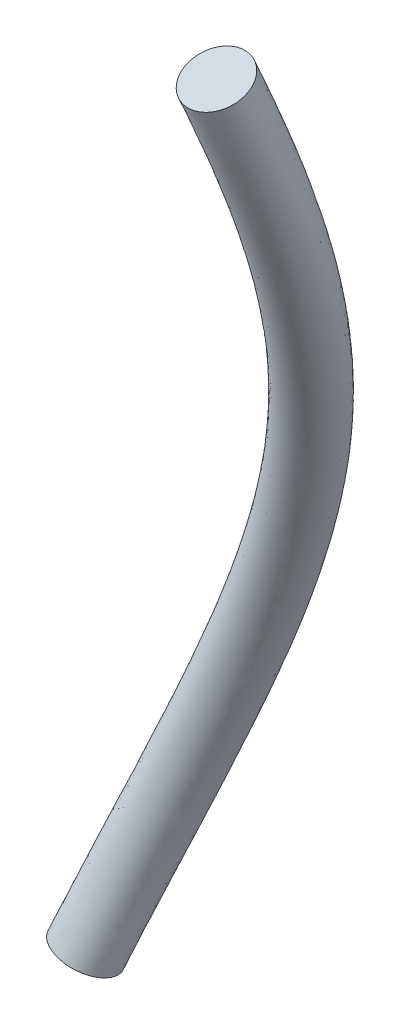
from build123d import *

# Parameters (mm, degrees)
SWEEP1_PITCH       = 47.625
SWEEP1_HEIGHT      = 19.05
SWEEP1_RADIUS      = 3.175
SWEEP1_START_ANGLE = -135
SKETCH2_R          = 0.5953125


with BuildPart() as part:
    # Sweep1: sweep along a helix
    with BuildLine() as sweep1_path:
        add(Helix(SWEEP1_PITCH, SWEEP1_HEIGHT, SWEEP1_RADIUS, center=(-37.597344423, 0, -18.738993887), direction=(0, 1, 0), lefthand=True, mode=Mode.PRIVATE).rotate(Axis((-37.597344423, 0, -18.738993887), (0, 1, 0)), SWEEP1_START_ANGLE))
    # Sketch2 → Sweep1 (sweep)
    with BuildSketch(Plane(origin=(-34.461433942, 19.05, -18.242314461), x_dir=(-0.27172876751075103, 0.3526542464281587, -0.8954319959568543), z_dir=(-0.06043898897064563, 0.9223508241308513, 0.3815967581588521))):
        with Locations((-0.021140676, 0.002550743)):
            Circle(SKETCH2_R)
    sweep(path=sweep1_path.line, is_frenet=True)


solid = part.part
